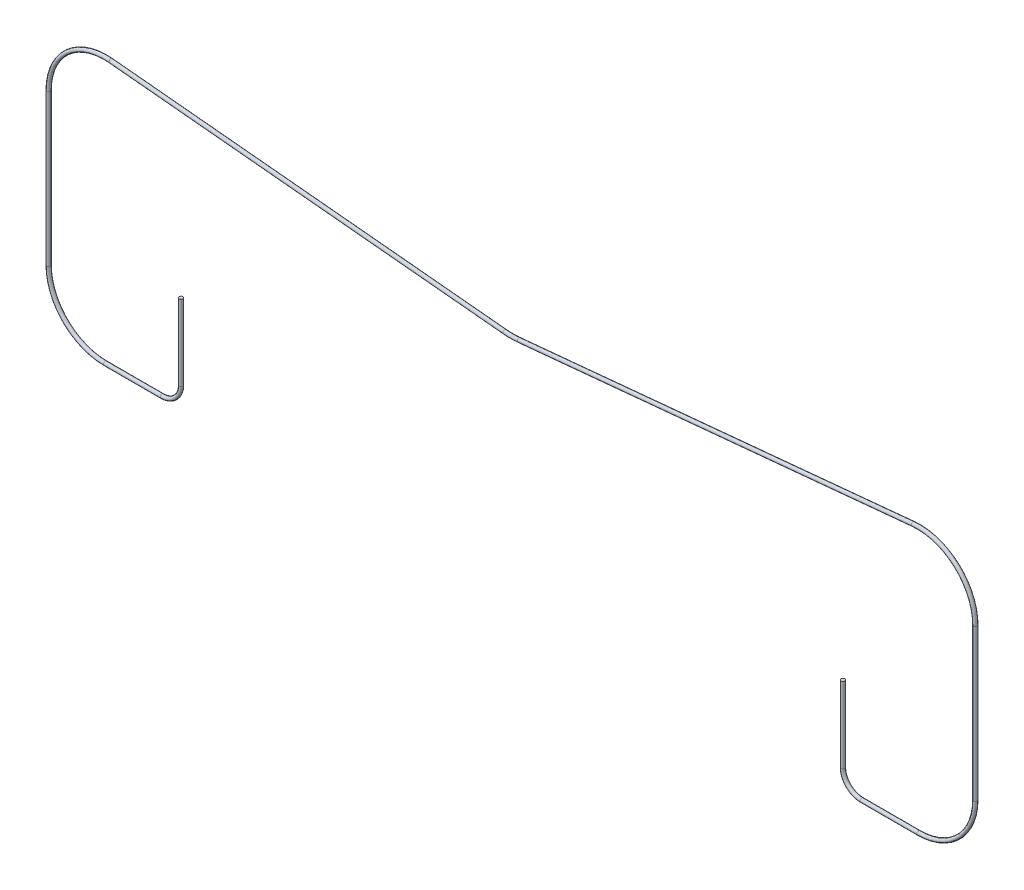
ISO-10303-21;
HEADER;
FILE_DESCRIPTION(('STEP AP214'),'2;1');
FILE_NAME('part.step','',(''),(''),'','','');
FILE_SCHEMA(('AUTOMOTIVE_DESIGN { 1 0 10303 214 1 1 1 1 }'));
ENDSEC;
DATA;
#1=APPLICATION_CONTEXT('core data for automotive mechanical design processes');
#2=APPLICATION_PROTOCOL_DEFINITION('international standard','automotive_design',2000,#1);
#3=PRODUCT_CONTEXT('',#1,'mechanical');
#4=PRODUCT('Part','Part','',(#3));
#5=PRODUCT_RELATED_PRODUCT_CATEGORY('part','',(#4));
#6=PRODUCT_DEFINITION_FORMATION('','',#4);
#7=PRODUCT_DEFINITION_CONTEXT('part definition',#1,'design');
#8=PRODUCT_DEFINITION('design','',#6,#7);
#9=PRODUCT_DEFINITION_SHAPE('','',#8);
#10=(LENGTH_UNIT() NAMED_UNIT(*) SI_UNIT(.MILLI.,.METRE.));
#11=(NAMED_UNIT(*) PLANE_ANGLE_UNIT() SI_UNIT($,.RADIAN.));
#12=(NAMED_UNIT(*) SI_UNIT($,.STERADIAN.) SOLID_ANGLE_UNIT());
#13=UNCERTAINTY_MEASURE_WITH_UNIT(LENGTH_MEASURE(1.E-05),#10,'distance_accuracy_value','');
#14=(GEOMETRIC_REPRESENTATION_CONTEXT(3) GLOBAL_UNCERTAINTY_ASSIGNED_CONTEXT((#13)) GLOBAL_UNIT_ASSIGNED_CONTEXT((#10,
#11,#12)) REPRESENTATION_CONTEXT('',''));
#15=CARTESIAN_POINT('',(0.,0.,0.));
#16=DIRECTION('',(0.,0.,1.));
#17=DIRECTION('',(1.,0.,0.));
#18=AXIS2_PLACEMENT_3D('',#15,#16,#17);
#19=CARTESIAN_POINT('',(3.,-4.,0.));
#20=DIRECTION('',(0.,0.,-1.));
#21=DIRECTION('',(-1.,0.,0.));
#22=AXIS2_PLACEMENT_3D('',#19,#20,#21);
#23=TOROIDAL_SURFACE('',#22,3.,0.1);
#24=CARTESIAN_POINT('',(3.,-7.,0.));
#25=DIRECTION('',(-1.,0.,0.));
#26=DIRECTION('',(0.,0.,1.));
#27=AXIS2_PLACEMENT_3D('',#24,#25,#26);
#28=CIRCLE('',#27,0.1);
#29=CARTESIAN_POINT('',(3.,-7.1,0.));
#30=VERTEX_POINT('',#29);
#31=EDGE_CURVE('E35',#30,#30,#28,.T.);
#32=CARTESIAN_POINT('',(0.,-4.,0.));
#33=DIRECTION('',(0.,1.,0.));
#34=DIRECTION('',(0.,0.,1.));
#35=AXIS2_PLACEMENT_3D('',#32,#33,#34);
#36=CIRCLE('',#35,0.1);
#37=CARTESIAN_POINT('',(-0.1,-4.,0.));
#38=VERTEX_POINT('',#37);
#39=EDGE_CURVE('E10',#38,#38,#36,.T.);
#40=CARTESIAN_POINT('',(3.,-4.,0.));
#41=DIRECTION('',(0.,0.,-1.));
#42=DIRECTION('',(-1.,0.,0.));
#43=AXIS2_PLACEMENT_3D('',#40,#41,#42);
#44=CIRCLE('',#43,3.1);
#45=EDGE_CURVE('',#30,#38,#44,.T.);
#46=ORIENTED_EDGE('',*,*,#31,.T.);
#47=ORIENTED_EDGE('',*,*,#39,.F.);
#48=ORIENTED_EDGE('',*,*,#45,.T.);
#49=ORIENTED_EDGE('',*,*,#45,.F.);
#50=EDGE_LOOP('',(#46,#48,#47,#49));
#51=FACE_BOUND('',#50,.T.);
#52=ADVANCED_FACE('F28',(#51),#23,.T.);
#53=CARTESIAN_POINT('',(6.,-7.,0.));
#54=DIRECTION('',(-1.,0.,0.));
#55=DIRECTION('',(0.,-1.,0.));
#56=AXIS2_PLACEMENT_3D('',#53,#54,#55);
#57=CYLINDRICAL_SURFACE('',#56,0.1);
#58=CARTESIAN_POINT('',(6.,-7.,0.));
#59=DIRECTION('',(-1.,0.,0.));
#60=DIRECTION('',(0.,0.,1.));
#61=AXIS2_PLACEMENT_3D('',#58,#59,#60);
#62=CIRCLE('',#61,0.1);
#63=CARTESIAN_POINT('',(6.,-7.10000000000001,0.));
#64=VERTEX_POINT('',#63);
#65=EDGE_CURVE('E39',#64,#64,#62,.T.);
#66=ORIENTED_EDGE('',*,*,#65,.T.);
#67=EDGE_LOOP('',(#66));
#68=FACE_BOUND('',#67,.T.);
#69=ORIENTED_EDGE('',*,*,#31,.F.);
#70=EDGE_LOOP('',(#69));
#71=FACE_BOUND('',#70,.T.);
#72=ADVANCED_FACE('F105',(#68,#71),#57,.T.);
#73=CARTESIAN_POINT('',(6.,-6.,0.));
#74=DIRECTION('',(0.,0.,-1.));
#75=DIRECTION('',(-1.,0.,0.));
#76=AXIS2_PLACEMENT_3D('',#73,#74,#75);
#77=TOROIDAL_SURFACE('',#76,1.00000000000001,0.1);
#78=CARTESIAN_POINT('',(7.00000000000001,-6.,0.));
#79=DIRECTION('',(0.,-1.,0.));
#80=DIRECTION('',(0.,0.,1.));
#81=AXIS2_PLACEMENT_3D('',#78,#79,#80);
#82=CIRCLE('',#81,0.1);
#83=CARTESIAN_POINT('',(7.10000000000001,-6.,0.));
#84=VERTEX_POINT('',#83);
#85=EDGE_CURVE('E44',#84,#84,#82,.T.);
#86=CARTESIAN_POINT('',(6.,-6.,0.));
#87=DIRECTION('',(0.,0.,-1.));
#88=DIRECTION('',(-1.,0.,0.));
#89=AXIS2_PLACEMENT_3D('',#86,#87,#88);
#90=CIRCLE('',#89,1.10000000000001);
#91=EDGE_CURVE('',#84,#64,#90,.T.);
#92=ORIENTED_EDGE('',*,*,#85,.T.);
#93=ORIENTED_EDGE('',*,*,#65,.F.);
#94=ORIENTED_EDGE('',*,*,#91,.T.);
#95=ORIENTED_EDGE('',*,*,#91,.F.);
#96=EDGE_LOOP('',(#92,#94,#93,#95));
#97=FACE_BOUND('',#96,.T.);
#98=ADVANCED_FACE('F110',(#97),#77,.T.);
#99=CARTESIAN_POINT('',(7.00000000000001,1.,0.));
#100=DIRECTION('',(0.,-1.,0.));
#101=DIRECTION('',(0.,0.,-1.));
#102=AXIS2_PLACEMENT_3D('',#99,#100,#101);
#103=CYLINDRICAL_SURFACE('',#102,0.1);
#104=CARTESIAN_POINT('',(7.00000000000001,-2.,0.));
#105=DIRECTION('',(0.,-1.,0.));
#106=DIRECTION('',(0.,0.,-1.));
#107=AXIS2_PLACEMENT_3D('',#104,#105,#106);
#108=CIRCLE('',#107,0.1);
#109=CARTESIAN_POINT('',(7.00000000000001,-2.,-0.1));
#110=VERTEX_POINT('',#109);
#111=EDGE_CURVE('E77',#110,#110,#108,.F.);
#112=ORIENTED_EDGE('',*,*,#111,.F.);
#113=EDGE_LOOP('',(#112));
#114=FACE_BOUND('',#113,.T.);
#115=ORIENTED_EDGE('',*,*,#85,.F.);
#116=EDGE_LOOP('',(#115));
#117=FACE_BOUND('',#116,.T.);
#118=ADVANCED_FACE('F90',(#114,#117),#103,.T.);
#119=CARTESIAN_POINT('',(42.,-6.,0.));
#120=DIRECTION('',(0.,1.,0.));
#121=DIRECTION('',(0.,0.,1.));
#122=AXIS2_PLACEMENT_3D('',#119,#120,#121);
#123=CYLINDRICAL_SURFACE('',#122,0.1);
#124=CARTESIAN_POINT('',(42.,-2.,0.));
#125=DIRECTION('',(0.,-1.,0.));
#126=DIRECTION('',(0.,0.,-1.));
#127=AXIS2_PLACEMENT_3D('',#124,#125,#126);
#128=CIRCLE('',#127,0.1);
#129=CARTESIAN_POINT('',(42.,-2.,-0.1));
#130=VERTEX_POINT('',#129);
#131=EDGE_CURVE('E31',#130,#130,#128,.F.);
#132=ORIENTED_EDGE('',*,*,#131,.F.);
#133=EDGE_LOOP('',(#132));
#134=FACE_BOUND('',#133,.T.);
#135=CARTESIAN_POINT('',(42.,-6.,0.));
#136=DIRECTION('',(0.,1.,0.));
#137=DIRECTION('',(0.,0.,1.));
#138=AXIS2_PLACEMENT_3D('',#135,#136,#137);
#139=CIRCLE('',#138,0.1);
#140=CARTESIAN_POINT('',(41.9,-6.,0.));
#141=VERTEX_POINT('',#140);
#142=EDGE_CURVE('E47',#141,#141,#139,.T.);
#143=ORIENTED_EDGE('',*,*,#142,.T.);
#144=EDGE_LOOP('',(#143));
#145=FACE_BOUND('',#144,.T.);
#146=ADVANCED_FACE('F86',(#134,#145),#123,.T.);
#147=CARTESIAN_POINT('',(43.,-5.99999999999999,0.));
#148=DIRECTION('',(0.,0.,-1.));
#149=DIRECTION('',(-1.,0.,0.));
#150=AXIS2_PLACEMENT_3D('',#147,#148,#149);
#151=TOROIDAL_SURFACE('',#150,0.999999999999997,0.1);
#152=CARTESIAN_POINT('',(43.,-6.99999999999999,0.));
#153=DIRECTION('',(-1.,0.,0.));
#154=DIRECTION('',(0.,0.,1.));
#155=AXIS2_PLACEMENT_3D('',#152,#153,#154);
#156=CIRCLE('',#155,0.1);
#157=CARTESIAN_POINT('',(43.,-7.09999999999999,0.));
#158=VERTEX_POINT('',#157);
#159=EDGE_CURVE('E50',#158,#158,#156,.T.);
#160=CARTESIAN_POINT('',(43.,-5.99999999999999,0.));
#161=DIRECTION('',(0.,0.,-1.));
#162=DIRECTION('',(-1.,0.,0.));
#163=AXIS2_PLACEMENT_3D('',#160,#161,#162);
#164=CIRCLE('',#163,1.1);
#165=EDGE_CURVE('',#158,#141,#164,.T.);
#166=ORIENTED_EDGE('',*,*,#159,.T.);
#167=ORIENTED_EDGE('',*,*,#142,.F.);
#168=ORIENTED_EDGE('',*,*,#165,.T.);
#169=ORIENTED_EDGE('',*,*,#165,.F.);
#170=EDGE_LOOP('',(#166,#168,#167,#169));
#171=FACE_BOUND('',#170,.T.);
#172=ADVANCED_FACE('F89',(#171),#151,.T.);
#173=CARTESIAN_POINT('',(46.,-6.99999999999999,0.));
#174=DIRECTION('',(-1.,0.,0.));
#175=DIRECTION('',(0.,0.,1.));
#176=AXIS2_PLACEMENT_3D('',#173,#174,#175);
#177=CYLINDRICAL_SURFACE('',#176,0.1);
#178=CARTESIAN_POINT('',(46.,-6.99999999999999,0.));
#179=DIRECTION('',(-1.,0.,0.));
#180=DIRECTION('',(0.,0.,1.));
#181=AXIS2_PLACEMENT_3D('',#178,#179,#180);
#182=CIRCLE('',#181,0.1);
#183=CARTESIAN_POINT('',(46.,-7.09999999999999,0.));
#184=VERTEX_POINT('',#183);
#185=EDGE_CURVE('E53',#184,#184,#182,.T.);
#186=ORIENTED_EDGE('',*,*,#185,.T.);
#187=EDGE_LOOP('',(#186));
#188=FACE_BOUND('',#187,.T.);
#189=ORIENTED_EDGE('',*,*,#159,.F.);
#190=EDGE_LOOP('',(#189));
#191=FACE_BOUND('',#190,.T.);
#192=ADVANCED_FACE('F95',(#188,#191),#177,.T.);
#193=CARTESIAN_POINT('',(46.,-3.99999999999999,0.));
#194=DIRECTION('',(0.,0.,-1.));
#195=DIRECTION('',(-1.,0.,0.));
#196=AXIS2_PLACEMENT_3D('',#193,#194,#195);
#197=TOROIDAL_SURFACE('',#196,3.,0.1);
#198=CARTESIAN_POINT('',(49.,-3.99999999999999,0.));
#199=DIRECTION('',(0.,-1.,0.));
#200=DIRECTION('',(0.,0.,1.));
#201=AXIS2_PLACEMENT_3D('',#198,#199,#200);
#202=CIRCLE('',#201,0.1);
#203=CARTESIAN_POINT('',(49.1,-3.99999999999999,0.));
#204=VERTEX_POINT('',#203);
#205=EDGE_CURVE('E56',#204,#204,#202,.T.);
#206=CARTESIAN_POINT('',(46.,-3.99999999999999,0.));
#207=DIRECTION('',(0.,0.,-1.));
#208=DIRECTION('',(-1.,0.,0.));
#209=AXIS2_PLACEMENT_3D('',#206,#207,#208);
#210=CIRCLE('',#209,3.1);
#211=EDGE_CURVE('',#204,#184,#210,.T.);
#212=ORIENTED_EDGE('',*,*,#205,.T.);
#213=ORIENTED_EDGE('',*,*,#185,.F.);
#214=ORIENTED_EDGE('',*,*,#211,.T.);
#215=ORIENTED_EDGE('',*,*,#211,.F.);
#216=EDGE_LOOP('',(#212,#214,#213,#215));
#217=FACE_BOUND('',#216,.T.);
#218=ADVANCED_FACE('F101',(#217),#197,.T.);
#219=CARTESIAN_POINT('',(49.,4.01370790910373,0.));
#220=DIRECTION('',(0.,-1.,0.));
#221=DIRECTION('',(0.,0.,-1.));
#222=AXIS2_PLACEMENT_3D('',#219,#220,#221);
#223=CYLINDRICAL_SURFACE('',#222,0.1);
#224=CARTESIAN_POINT('',(49.,4.01370790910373,0.));
#225=DIRECTION('',(0.,-1.,0.));
#226=DIRECTION('',(0.,0.,1.));
#227=AXIS2_PLACEMENT_3D('',#224,#225,#226);
#228=CIRCLE('',#227,0.1);
#229=CARTESIAN_POINT('',(49.1,4.01370790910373,0.));
#230=VERTEX_POINT('',#229);
#231=EDGE_CURVE('E59',#230,#230,#228,.T.);
#232=ORIENTED_EDGE('',*,*,#231,.T.);
#233=EDGE_LOOP('',(#232));
#234=FACE_BOUND('',#233,.T.);
#235=ORIENTED_EDGE('',*,*,#205,.F.);
#236=EDGE_LOOP('',(#235));
#237=FACE_BOUND('',#236,.T.);
#238=ADVANCED_FACE('F182',(#234,#237),#223,.T.);
#239=CARTESIAN_POINT('',(46.,4.01370790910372,0.));
#240=DIRECTION('',(0.,0.,-1.));
#241=DIRECTION('',(-1.,0.,0.));
#242=AXIS2_PLACEMENT_3D('',#239,#240,#241);
#243=TOROIDAL_SURFACE('',#242,3.,0.1);
#244=CARTESIAN_POINT('',(45.7141903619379,7.00006235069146,0.));
#245=DIRECTION('',(0.995451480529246,0.0952698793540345,0.));
#246=DIRECTION('',(0.,0.,1.));
#247=AXIS2_PLACEMENT_3D('',#244,#245,#246);
#248=CIRCLE('',#247,0.1);
#249=CARTESIAN_POINT('',(45.7046633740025,7.09960749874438,0.));
#250=VERTEX_POINT('',#249);
#251=EDGE_CURVE('E62',#250,#250,#248,.T.);
#252=CARTESIAN_POINT('',(46.,4.01370790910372,0.));
#253=DIRECTION('',(0.,0.,-1.));
#254=DIRECTION('',(-1.,0.,0.));
#255=AXIS2_PLACEMENT_3D('',#252,#253,#254);
#256=CIRCLE('',#255,3.1);
#257=EDGE_CURVE('',#250,#230,#256,.T.);
#258=ORIENTED_EDGE('',*,*,#251,.T.);
#259=ORIENTED_EDGE('',*,*,#231,.F.);
#260=ORIENTED_EDGE('',*,*,#257,.T.);
#261=ORIENTED_EDGE('',*,*,#257,.F.);
#262=EDGE_LOOP('',(#258,#260,#259,#261));
#263=FACE_BOUND('',#262,.T.);
#264=ADVANCED_FACE('F178',(#263),#243,.T.);
#265=CARTESIAN_POINT('',(24.8810795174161,5.00622538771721,0.));
#266=DIRECTION('',(0.995451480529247,0.0952698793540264,0.));
#267=DIRECTION('',(-0.0952698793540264,0.995451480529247,0.));
#268=AXIS2_PLACEMENT_3D('',#265,#266,#267);
#269=CYLINDRICAL_SURFACE('',#268,0.1);
#270=CARTESIAN_POINT('',(24.8810795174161,5.00622538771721,0.));
#271=DIRECTION('',(0.995451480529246,0.0952698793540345,0.));
#272=DIRECTION('',(0.,0.,1.));
#273=AXIS2_PLACEMENT_3D('',#270,#271,#272);
#274=CIRCLE('',#273,0.1);
#275=CARTESIAN_POINT('',(24.8906065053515,4.90668023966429,0.));
#276=VERTEX_POINT('',#275);
#277=EDGE_CURVE('E65',#276,#276,#274,.T.);
#278=ORIENTED_EDGE('',*,*,#277,.T.);
#279=EDGE_LOOP('',(#278));
#280=FACE_BOUND('',#279,.T.);
#281=ORIENTED_EDGE('',*,*,#251,.F.);
#282=EDGE_LOOP('',(#281));
#283=FACE_BOUND('',#282,.T.);
#284=ADVANCED_FACE('F174',(#280,#283),#269,.T.);
#285=CARTESIAN_POINT('',(24.5,8.9880313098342,0.));
#286=DIRECTION('',(0.,0.,1.));
#287=DIRECTION('',(1.,0.,0.));
#288=AXIS2_PLACEMENT_3D('',#285,#286,#287);
#289=TOROIDAL_SURFACE('',#288,4.,0.1);
#290=CARTESIAN_POINT('',(24.1189204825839,5.00622538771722,0.));
#291=DIRECTION('',(0.995451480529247,-0.0952698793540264,0.));
#292=DIRECTION('',(0.,0.,1.));
#293=AXIS2_PLACEMENT_3D('',#290,#291,#292);
#294=CIRCLE('',#293,0.1);
#295=CARTESIAN_POINT('',(24.1093934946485,4.90668023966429,0.));
#296=VERTEX_POINT('',#295);
#297=EDGE_CURVE('E68',#296,#296,#294,.T.);
#298=CARTESIAN_POINT('',(24.5,8.9880313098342,0.));
#299=DIRECTION('',(0.,0.,1.));
#300=DIRECTION('',(1.,0.,0.));
#301=AXIS2_PLACEMENT_3D('',#298,#299,#300);
#302=CIRCLE('',#301,4.1);
#303=EDGE_CURVE('',#296,#276,#302,.T.);
#304=ORIENTED_EDGE('',*,*,#297,.T.);
#305=ORIENTED_EDGE('',*,*,#277,.F.);
#306=ORIENTED_EDGE('',*,*,#303,.T.);
#307=ORIENTED_EDGE('',*,*,#303,.F.);
#308=EDGE_LOOP('',(#304,#306,#305,#307));
#309=FACE_BOUND('',#308,.T.);
#310=ADVANCED_FACE('F170',(#309),#289,.T.);
#311=CARTESIAN_POINT('',(3.28580963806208,7.00006235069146,0.));
#312=DIRECTION('',(0.995451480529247,-0.0952698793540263,0.));
#313=DIRECTION('',(0.0952698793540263,0.995451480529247,0.));
#314=AXIS2_PLACEMENT_3D('',#311,#312,#313);
#315=CYLINDRICAL_SURFACE('',#314,0.1);
#316=CARTESIAN_POINT('',(3.28580963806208,7.00006235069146,0.));
#317=DIRECTION('',(0.995451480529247,-0.0952698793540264,0.));
#318=DIRECTION('',(0.,0.,1.));
#319=AXIS2_PLACEMENT_3D('',#316,#317,#318);
#320=CIRCLE('',#319,0.1);
#321=CARTESIAN_POINT('',(3.29533662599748,7.09960749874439,0.));
#322=VERTEX_POINT('',#321);
#323=EDGE_CURVE('E71',#322,#322,#320,.T.);
#324=ORIENTED_EDGE('',*,*,#323,.T.);
#325=EDGE_LOOP('',(#324));
#326=FACE_BOUND('',#325,.T.);
#327=ORIENTED_EDGE('',*,*,#297,.F.);
#328=EDGE_LOOP('',(#327));
#329=FACE_BOUND('',#328,.T.);
#330=ADVANCED_FACE('F166',(#326,#329),#315,.T.);
#331=CARTESIAN_POINT('',(3.,4.01370790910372,0.));
#332=DIRECTION('',(0.,0.,-1.));
#333=DIRECTION('',(-1.,0.,0.));
#334=AXIS2_PLACEMENT_3D('',#331,#332,#333);
#335=TOROIDAL_SURFACE('',#334,3.,0.1);
#336=CARTESIAN_POINT('',(0.,4.01370790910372,0.));
#337=DIRECTION('',(0.,1.,0.));
#338=DIRECTION('',(0.,0.,1.));
#339=AXIS2_PLACEMENT_3D('',#336,#337,#338);
#340=CIRCLE('',#339,0.1);
#341=CARTESIAN_POINT('',(-0.0999999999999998,4.01370790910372,0.));
#342=VERTEX_POINT('',#341);
#343=EDGE_CURVE('E74',#342,#342,#340,.T.);
#344=CARTESIAN_POINT('',(3.,4.01370790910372,0.));
#345=DIRECTION('',(0.,0.,-1.));
#346=DIRECTION('',(-1.,0.,0.));
#347=AXIS2_PLACEMENT_3D('',#344,#345,#346);
#348=CIRCLE('',#347,3.1);
#349=EDGE_CURVE('',#342,#322,#348,.T.);
#350=ORIENTED_EDGE('',*,*,#343,.T.);
#351=ORIENTED_EDGE('',*,*,#323,.F.);
#352=ORIENTED_EDGE('',*,*,#349,.T.);
#353=ORIENTED_EDGE('',*,*,#349,.F.);
#354=EDGE_LOOP('',(#350,#352,#351,#353));
#355=FACE_BOUND('',#354,.T.);
#356=ADVANCED_FACE('F162',(#355),#335,.T.);
#357=CARTESIAN_POINT('',(0.,4.01370790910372,0.));
#358=DIRECTION('',(0.,-1.,0.));
#359=DIRECTION('',(1.,0.,0.));
#360=AXIS2_PLACEMENT_3D('',#357,#358,#359);
#361=CYLINDRICAL_SURFACE('',#360,0.1);
#362=ORIENTED_EDGE('',*,*,#343,.F.);
#363=EDGE_LOOP('',(#362));
#364=FACE_BOUND('',#363,.T.);
#365=ORIENTED_EDGE('',*,*,#39,.T.);
#366=EDGE_LOOP('',(#365));
#367=FACE_BOUND('',#366,.T.);
#368=ADVANCED_FACE('F147',(#364,#367),#361,.T.);
#369=CARTESIAN_POINT('',(5.19919514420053,-2.,-5.));
#370=DIRECTION('',(0.,-1.,0.));
#371=DIRECTION('',(0.,0.,-1.));
#372=AXIS2_PLACEMENT_3D('',#369,#370,#371);
#373=PLANE('',#372);
#374=ORIENTED_EDGE('',*,*,#131,.T.);
#375=EDGE_LOOP('',(#374));
#376=FACE_BOUND('',#375,.T.);
#377=ADVANCED_FACE('F84',(#376),#373,.F.);
#378=ORIENTED_EDGE('',*,*,#111,.T.);
#379=EDGE_LOOP('',(#378));
#380=FACE_BOUND('',#379,.T.);
#381=ADVANCED_FACE('F146',(#380),#373,.F.);
#382=CLOSED_SHELL('',(#52,#72,#98,#118,#146,#172,#192,#218,#238,#264,#284,#310,#330,#356,#368,
#377,#381));
#383=MANIFOLD_SOLID_BREP('B2',#382);
#384=ADVANCED_BREP_SHAPE_REPRESENTATION('',(#18,#383),#14);
#385=SHAPE_DEFINITION_REPRESENTATION(#9,#384);
ENDSEC;
END-ISO-10303-21;
